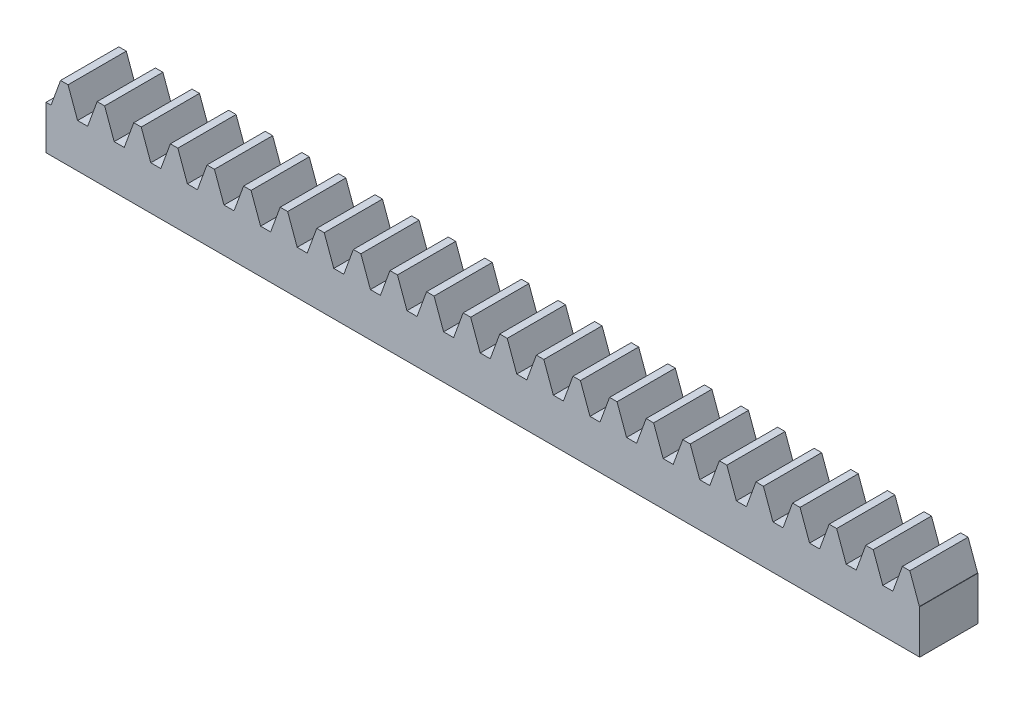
from build123d import *

# Parameters (mm, degrees)
BLANKSKE_W        = 150
BLANKSKE_H        = 12
BLANK_DEPTH       = 10
TOOTHCUTSIM_DEPTH = 151.811140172
TEETHCUTS_COUNT   = 25
TEETHCUTS_PITCH   = 6.2831853


with BuildPart() as part:
    # BlankSke → Blank (new body)
    with BuildSketch(Plane.XY):
        with Locations((75, 6)):
            Rectangle(BLANKSKE_W, BLANKSKE_H)
    extrude(amount=-BLANK_DEPTH)

    # TooCutSkeSim → ToothCutSim (cut, through all)
    with BuildSketch(Plane.XY):
        Polygon((0.861870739, 7.5), (-0.861870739, 7.5), (-2.508981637, 12.0254), (2.508981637, 12.0254), align=None)
    toothcutsim = extrude(amount=-TOOTHCUTSIM_DEPTH, mode=Mode.SUBTRACT)

    # TeethCuts: ToothCutSim ×25
    with Locations(*[(i * TEETHCUTS_PITCH, 0, 0) for i in range(1, TEETHCUTS_COUNT)]):
        add(toothcutsim, mode=Mode.SUBTRACT)


solid = part.part
